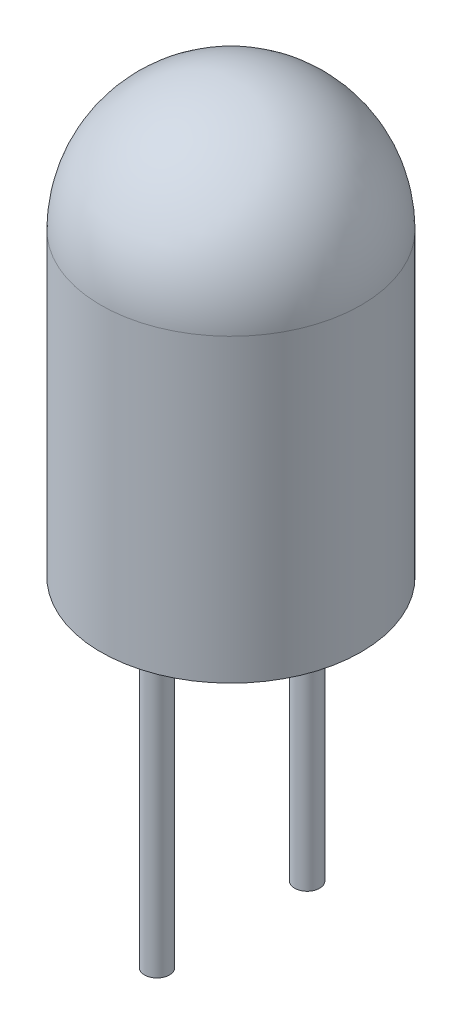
ISO-10303-21;
HEADER;
FILE_DESCRIPTION(('STEP AP214'),'2;1');
FILE_NAME('part.step','',(''),(''),'','','');
FILE_SCHEMA(('AUTOMOTIVE_DESIGN { 1 0 10303 214 1 1 1 1 }'));
ENDSEC;
DATA;
#1=APPLICATION_CONTEXT('core data for automotive mechanical design processes');
#2=APPLICATION_PROTOCOL_DEFINITION('international standard','automotive_design',2000,#1);
#3=PRODUCT_CONTEXT('',#1,'mechanical');
#4=PRODUCT('Part','Part','',(#3));
#5=PRODUCT_RELATED_PRODUCT_CATEGORY('part','',(#4));
#6=PRODUCT_DEFINITION_FORMATION('','',#4);
#7=PRODUCT_DEFINITION_CONTEXT('part definition',#1,'design');
#8=PRODUCT_DEFINITION('design','',#6,#7);
#9=PRODUCT_DEFINITION_SHAPE('','',#8);
#10=(LENGTH_UNIT() NAMED_UNIT(*) SI_UNIT(.MILLI.,.METRE.));
#11=(NAMED_UNIT(*) PLANE_ANGLE_UNIT() SI_UNIT($,.RADIAN.));
#12=(NAMED_UNIT(*) SI_UNIT($,.STERADIAN.) SOLID_ANGLE_UNIT());
#13=UNCERTAINTY_MEASURE_WITH_UNIT(LENGTH_MEASURE(1.E-05),#10,'distance_accuracy_value','');
#14=(GEOMETRIC_REPRESENTATION_CONTEXT(3) GLOBAL_UNCERTAINTY_ASSIGNED_CONTEXT((#13)) GLOBAL_UNIT_ASSIGNED_CONTEXT((#10,
#11,#12)) REPRESENTATION_CONTEXT('',''));
#15=CARTESIAN_POINT('',(0.,0.,0.));
#16=DIRECTION('',(0.,0.,1.));
#17=DIRECTION('',(1.,0.,0.));
#18=AXIS2_PLACEMENT_3D('',#15,#16,#17);
#19=CARTESIAN_POINT('',(-1.11022302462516E-13,-8.59999999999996,0.));
#20=DIRECTION('',(0.,-0.999999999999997,0.));
#21=DIRECTION('',(1.00000000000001,0.,0.));
#22=AXIS2_PLACEMENT_3D('',#19,#20,#21);
#23=PLANE('',#22);
#24=CARTESIAN_POINT('',(0.0221566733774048,-8.59999999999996,1.49983635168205));
#25=DIRECTION('',(0.,-0.999999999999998,0.));
#26=DIRECTION('',(0.,0.,-1.));
#27=AXIS2_PLACEMENT_3D('',#24,#25,#26);
#28=CIRCLE('',#27,0.25);
#29=CARTESIAN_POINT('',(0.022156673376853,-8.59999999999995,1.74983635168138));
#30=VERTEX_POINT('',#29);
#31=EDGE_CURVE('E34',#30,#30,#28,.T.);
#32=ORIENTED_EDGE('',*,*,#31,.F.);
#33=EDGE_LOOP('',(#32));
#34=FACE_BOUND('',#33,.T.);
#35=CARTESIAN_POINT('',(-1.11022302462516E-13,-8.59999999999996,0.));
#36=DIRECTION('',(0.,-0.999999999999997,0.));
#37=DIRECTION('',(1.00000000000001,0.,0.));
#38=AXIS2_PLACEMENT_3D('',#35,#36,#37);
#39=CIRCLE('',#38,2.60000000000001);
#40=CARTESIAN_POINT('',(2.59999999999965,-8.59999999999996,1.83613667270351E-13));
#41=VERTEX_POINT('',#40);
#42=EDGE_CURVE('E10',#41,#41,#39,.T.);
#43=ORIENTED_EDGE('',*,*,#42,.T.);
#44=EDGE_LOOP('',(#43));
#45=FACE_BOUND('',#44,.T.);
#46=CARTESIAN_POINT('',(0.0221566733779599,-8.59999999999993,-1.49983635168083));
#47=DIRECTION('',(0.,-0.999999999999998,0.));
#48=DIRECTION('',(0.,0.,1.));
#49=AXIS2_PLACEMENT_3D('',#46,#47,#48);
#50=CIRCLE('',#49,0.25);
#51=CARTESIAN_POINT('',(0.0221566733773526,-8.59999999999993,-1.24983635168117));
#52=VERTEX_POINT('',#51);
#53=EDGE_CURVE('E42',#52,#52,#50,.T.);
#54=ORIENTED_EDGE('',*,*,#53,.F.);
#55=EDGE_LOOP('',(#54));
#56=FACE_BOUND('',#55,.T.);
#57=ADVANCED_FACE('F20',(#34,#45,#56),#23,.T.);
#58=CARTESIAN_POINT('',(-3.88578058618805E-13,-39.9142857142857,2.22044604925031E-13));
#59=DIRECTION('',(0.,-0.999999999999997,0.));
#60=DIRECTION('',(1.00000000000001,0.,0.));
#61=AXIS2_PLACEMENT_3D('',#58,#59,#60);
#62=CYLINDRICAL_SURFACE('',#61,2.60000000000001);
#63=CARTESIAN_POINT('',(8.32667268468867E-13,-2.59999999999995,7.7715611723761E-13));
#64=DIRECTION('',(0.,-0.999999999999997,0.));
#65=DIRECTION('',(1.00000000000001,0.,0.));
#66=AXIS2_PLACEMENT_3D('',#63,#64,#65);
#67=CIRCLE('',#66,2.60000000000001);
#68=CARTESIAN_POINT('',(2.59999999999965,-2.59999999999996,1.76549046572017E-13));
#69=VERTEX_POINT('',#68);
#70=EDGE_CURVE('E26',#69,#69,#67,.T.);
#71=CARTESIAN_POINT('',(2.59999999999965,-2.59999999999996,1.76549046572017E-13));
#72=CARTESIAN_POINT('',(2.59999999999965,-2.66249999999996,1.76622636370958E-13));
#73=CARTESIAN_POINT('',(2.59999999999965,-2.72499999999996,1.76696226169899E-13));
#74=CARTESIAN_POINT('',(2.59999999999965,-2.84999999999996,1.76843405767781E-13));
#75=CARTESIAN_POINT('',(2.59999999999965,-2.91249999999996,1.76916995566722E-13));
#76=CARTESIAN_POINT('',(2.59999999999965,-3.03749999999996,1.77064175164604E-13));
#77=CARTESIAN_POINT('',(2.59999999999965,-3.09999999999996,1.77137764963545E-13));
#78=CARTESIAN_POINT('',(2.59999999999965,-3.22499999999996,1.77284944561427E-13));
#79=CARTESIAN_POINT('',(2.59999999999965,-3.28749999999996,1.77358534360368E-13));
#80=CARTESIAN_POINT('',(2.59999999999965,-3.41249999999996,1.7750571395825E-13));
#81=CARTESIAN_POINT('',(2.59999999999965,-3.47499999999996,1.77579303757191E-13));
#82=CARTESIAN_POINT('',(2.59999999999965,-3.59999999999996,1.77726483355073E-13));
#83=CARTESIAN_POINT('',(2.59999999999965,-3.66249999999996,1.77800073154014E-13));
#84=CARTESIAN_POINT('',(2.59999999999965,-3.78749999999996,1.77947252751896E-13));
#85=CARTESIAN_POINT('',(2.59999999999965,-3.84999999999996,1.78020842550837E-13));
#86=CARTESIAN_POINT('',(2.59999999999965,-3.97499999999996,1.78168022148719E-13));
#87=CARTESIAN_POINT('',(2.59999999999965,-4.03749999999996,1.7824161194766E-13));
#88=CARTESIAN_POINT('',(2.59999999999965,-4.16249999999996,1.78388791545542E-13));
#89=CARTESIAN_POINT('',(2.59999999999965,-4.22499999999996,1.78462381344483E-13));
#90=CARTESIAN_POINT('',(2.59999999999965,-4.34999999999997,1.78609560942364E-13));
#91=CARTESIAN_POINT('',(2.59999999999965,-4.41249999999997,1.78683150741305E-13));
#92=CARTESIAN_POINT('',(2.59999999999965,-4.53749999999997,1.78830330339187E-13));
#93=CARTESIAN_POINT('',(2.59999999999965,-4.59999999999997,1.78903920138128E-13));
#94=CARTESIAN_POINT('',(2.59999999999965,-4.72499999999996,1.7905109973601E-13));
#95=CARTESIAN_POINT('',(2.59999999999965,-4.78749999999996,1.79124689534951E-13));
#96=CARTESIAN_POINT('',(2.59999999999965,-4.91249999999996,1.79271869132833E-13));
#97=CARTESIAN_POINT('',(2.59999999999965,-4.97499999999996,1.79345458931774E-13));
#98=CARTESIAN_POINT('',(2.59999999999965,-5.09999999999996,1.79492638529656E-13));
#99=CARTESIAN_POINT('',(2.59999999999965,-5.16249999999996,1.79566228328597E-13));
#100=CARTESIAN_POINT('',(2.59999999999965,-5.28749999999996,1.79713407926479E-13));
#101=CARTESIAN_POINT('',(2.59999999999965,-5.34999999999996,1.7978699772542E-13));
#102=CARTESIAN_POINT('',(2.59999999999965,-5.47499999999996,1.79934177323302E-13));
#103=CARTESIAN_POINT('',(2.59999999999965,-5.53749999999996,1.80007767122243E-13));
#104=CARTESIAN_POINT('',(2.59999999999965,-5.66249999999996,1.80154946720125E-13));
#105=CARTESIAN_POINT('',(2.59999999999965,-5.72499999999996,1.80228536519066E-13));
#106=CARTESIAN_POINT('',(2.59999999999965,-5.84999999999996,1.80375716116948E-13));
#107=CARTESIAN_POINT('',(2.59999999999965,-5.91249999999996,1.80449305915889E-13));
#108=CARTESIAN_POINT('',(2.59999999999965,-6.03749999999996,1.80596485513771E-13));
#109=CARTESIAN_POINT('',(2.59999999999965,-6.09999999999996,1.80670075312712E-13));
#110=CARTESIAN_POINT('',(2.59999999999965,-6.22499999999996,1.80817254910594E-13));
#111=CARTESIAN_POINT('',(2.59999999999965,-6.28749999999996,1.80890844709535E-13));
#112=CARTESIAN_POINT('',(2.59999999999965,-6.41249999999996,1.81038024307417E-13));
#113=CARTESIAN_POINT('',(2.59999999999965,-6.47499999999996,1.81111614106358E-13));
#114=CARTESIAN_POINT('',(2.59999999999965,-6.59999999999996,1.8125879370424E-13));
#115=CARTESIAN_POINT('',(2.59999999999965,-6.66249999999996,1.81332383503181E-13));
#116=CARTESIAN_POINT('',(2.59999999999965,-6.78749999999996,1.81479563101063E-13));
#117=CARTESIAN_POINT('',(2.59999999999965,-6.84999999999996,1.81553152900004E-13));
#118=CARTESIAN_POINT('',(2.59999999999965,-6.97499999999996,1.81700332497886E-13));
#119=CARTESIAN_POINT('',(2.59999999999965,-7.03749999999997,1.81773922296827E-13));
#120=CARTESIAN_POINT('',(2.59999999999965,-7.16249999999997,1.81921101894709E-13));
#121=CARTESIAN_POINT('',(2.59999999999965,-7.22499999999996,1.8199469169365E-13));
#122=CARTESIAN_POINT('',(2.59999999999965,-7.34999999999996,1.82141871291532E-13));
#123=CARTESIAN_POINT('',(2.59999999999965,-7.41249999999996,1.82215461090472E-13));
#124=CARTESIAN_POINT('',(2.59999999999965,-7.53749999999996,1.82362640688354E-13));
#125=CARTESIAN_POINT('',(2.59999999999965,-7.59999999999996,1.82436230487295E-13));
#126=CARTESIAN_POINT('',(2.59999999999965,-7.72499999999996,1.82583410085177E-13));
#127=CARTESIAN_POINT('',(2.59999999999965,-7.78749999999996,1.82656999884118E-13));
#128=CARTESIAN_POINT('',(2.59999999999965,-7.91249999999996,1.82804179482E-13));
#129=CARTESIAN_POINT('',(2.59999999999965,-7.97499999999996,1.82877769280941E-13));
#130=CARTESIAN_POINT('',(2.59999999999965,-8.09999999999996,1.83024948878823E-13));
#131=CARTESIAN_POINT('',(2.59999999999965,-8.16249999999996,1.83098538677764E-13));
#132=CARTESIAN_POINT('',(2.59999999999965,-8.28749999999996,1.83245718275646E-13));
#133=CARTESIAN_POINT('',(2.59999999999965,-8.34999999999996,1.83319308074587E-13));
#134=CARTESIAN_POINT('',(2.59999999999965,-8.47499999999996,1.83466487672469E-13));
#135=CARTESIAN_POINT('',(2.59999999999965,-8.53749999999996,1.8354007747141E-13));
#136=CARTESIAN_POINT('',(2.59999999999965,-8.59999999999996,1.83613667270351E-13));
#137=B_SPLINE_CURVE_WITH_KNOTS('',3,(#71,#72,#73,#74,#75,#76,#77,#78,#79,#80,#81,#82,#83,#84,
#85,#86,#87,#88,#89,#90,#91,#92,#93,#94,#95,#96,#97,#98,#99,#100,#101,#102,#103,#104,#105,#106,
#107,#108,#109,#110,#111,#112,#113,#114,#115,#116,#117,#118,#119,#120,#121,#122,#123,#124,#125,
#126,#127,#128,#129,#130,#131,#132,#133,#134,#135,#136),.UNSPECIFIED.,.F.,.F.,(4,2,2,2,2,2,2,2,
2,2,2,2,2,2,2,2,2,2,2,2,2,2,2,2,2,2,2,2,2,2,2,2,4),(0.,0.1875,0.375,0.5625,0.750000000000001,
0.937500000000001,1.125,1.3125,1.5,1.68750000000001,1.87500000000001,2.06250000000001,2.25,
2.4375,2.625,2.8125,3.,3.1875,3.375,3.5625,3.75,3.9375,4.125,4.3125,4.50000000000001,4.6875,
4.875,5.0625,5.25,5.4375,5.62500000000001,5.81250000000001,6.00000000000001),.UNSPECIFIED.);
#138=EDGE_CURVE('BSEAM49',#69,#41,#137,.T.);
#139=ORIENTED_EDGE('',*,*,#70,.T.);
#140=ORIENTED_EDGE('',*,*,#42,.F.);
#141=ORIENTED_EDGE('',*,*,#138,.T.);
#142=ORIENTED_EDGE('',*,*,#138,.F.);
#143=EDGE_LOOP('',(#139,#141,#140,#142));
#144=FACE_BOUND('',#143,.T.);
#145=ADVANCED_FACE('F49',(#144),#62,.T.);
#146=CARTESIAN_POINT('',(8.32667268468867E-13,-2.59999999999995,7.7715611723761E-13));
#147=DIRECTION('',(0.,-0.999999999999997,0.));
#148=DIRECTION('',(1.00000000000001,0.,0.));
#149=AXIS2_PLACEMENT_3D('',#146,#147,#148);
#150=SPHERICAL_SURFACE('',#149,2.6);
#151=ORIENTED_EDGE('',*,*,#70,.F.);
#152=EDGE_LOOP('',(#151));
#153=FACE_BOUND('',#152,.T.);
#154=ADVANCED_FACE('F56',(#153),#150,.T.);
#155=CARTESIAN_POINT('',(0.0221566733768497,-14.6,1.49983635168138));
#156=DIRECTION('',(0.,0.999999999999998,0.));
#157=DIRECTION('',(0.,0.,1.));
#158=AXIS2_PLACEMENT_3D('',#155,#156,#157);
#159=CYLINDRICAL_SURFACE('',#158,0.25);
#160=CARTESIAN_POINT('',(0.0221566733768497,-14.6,1.49983635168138));
#161=DIRECTION('',(0.,-0.999999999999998,0.));
#162=DIRECTION('',(0.,0.,-1.));
#163=AXIS2_PLACEMENT_3D('',#160,#161,#162);
#164=CIRCLE('',#163,0.25);
#165=CARTESIAN_POINT('',(0.0221566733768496,-14.6,1.74983635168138));
#166=VERTEX_POINT('',#165);
#167=EDGE_CURVE('E30',#166,#166,#164,.T.);
#168=CARTESIAN_POINT('',(0.0221566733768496,-14.6,1.74983635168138));
#169=CARTESIAN_POINT('',(0.0221566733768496,-14.5375,1.74983635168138));
#170=CARTESIAN_POINT('',(0.0221566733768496,-14.475,1.74983635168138));
#171=CARTESIAN_POINT('',(0.0221566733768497,-14.35,1.74983635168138));
#172=CARTESIAN_POINT('',(0.0221566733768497,-14.2875,1.74983635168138));
#173=CARTESIAN_POINT('',(0.0221566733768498,-14.1625,1.74983635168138));
#174=CARTESIAN_POINT('',(0.0221566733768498,-14.1,1.74983635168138));
#175=CARTESIAN_POINT('',(0.0221566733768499,-13.975,1.74983635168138));
#176=CARTESIAN_POINT('',(0.02215667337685,-13.9125,1.74983635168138));
#177=CARTESIAN_POINT('',(0.02215667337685,-13.7875,1.74983635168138));
#178=CARTESIAN_POINT('',(0.0221566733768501,-13.725,1.74983635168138));
#179=CARTESIAN_POINT('',(0.0221566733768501,-13.6,1.74983635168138));
#180=CARTESIAN_POINT('',(0.0221566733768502,-13.5375,1.74983635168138));
#181=CARTESIAN_POINT('',(0.0221566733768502,-13.4125,1.74983635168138));
#182=CARTESIAN_POINT('',(0.0221566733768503,-13.35,1.74983635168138));
#183=CARTESIAN_POINT('',(0.0221566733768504,-13.225,1.74983635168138));
#184=CARTESIAN_POINT('',(0.0221566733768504,-13.1625,1.74983635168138));
#185=CARTESIAN_POINT('',(0.0221566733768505,-13.0375,1.74983635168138));
#186=CARTESIAN_POINT('',(0.0221566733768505,-12.975,1.74983635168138));
#187=CARTESIAN_POINT('',(0.0221566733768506,-12.85,1.74983635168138));
#188=CARTESIAN_POINT('',(0.0221566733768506,-12.7875,1.74983635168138));
#189=CARTESIAN_POINT('',(0.0221566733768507,-12.6625,1.74983635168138));
#190=CARTESIAN_POINT('',(0.0221566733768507,-12.6,1.74983635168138));
#191=CARTESIAN_POINT('',(0.0221566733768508,-12.475,1.74983635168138));
#192=CARTESIAN_POINT('',(0.0221566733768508,-12.4125,1.74983635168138));
#193=CARTESIAN_POINT('',(0.0221566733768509,-12.2875,1.74983635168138));
#194=CARTESIAN_POINT('',(0.0221566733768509,-12.225,1.74983635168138));
#195=CARTESIAN_POINT('',(0.022156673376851,-12.1,1.74983635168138));
#196=CARTESIAN_POINT('',(0.022156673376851,-12.0375,1.74983635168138));
#197=CARTESIAN_POINT('',(0.0221566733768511,-11.9125,1.74983635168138));
#198=CARTESIAN_POINT('',(0.0221566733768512,-11.85,1.74983635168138));
#199=CARTESIAN_POINT('',(0.0221566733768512,-11.725,1.74983635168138));
#200=CARTESIAN_POINT('',(0.0221566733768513,-11.6625,1.74983635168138));
#201=CARTESIAN_POINT('',(0.0221566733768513,-11.5375,1.74983635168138));
#202=CARTESIAN_POINT('',(0.0221566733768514,-11.475,1.74983635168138));
#203=CARTESIAN_POINT('',(0.0221566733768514,-11.35,1.74983635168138));
#204=CARTESIAN_POINT('',(0.0221566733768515,-11.2875,1.74983635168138));
#205=CARTESIAN_POINT('',(0.0221566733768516,-11.1625,1.74983635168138));
#206=CARTESIAN_POINT('',(0.0221566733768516,-11.1,1.74983635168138));
#207=CARTESIAN_POINT('',(0.0221566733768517,-10.975,1.74983635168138));
#208=CARTESIAN_POINT('',(0.0221566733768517,-10.9125,1.74983635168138));
#209=CARTESIAN_POINT('',(0.0221566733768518,-10.7875,1.74983635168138));
#210=CARTESIAN_POINT('',(0.0221566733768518,-10.725,1.74983635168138));
#211=CARTESIAN_POINT('',(0.0221566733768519,-10.6,1.74983635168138));
#212=CARTESIAN_POINT('',(0.0221566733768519,-10.5375,1.74983635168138));
#213=CARTESIAN_POINT('',(0.022156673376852,-10.4125,1.74983635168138));
#214=CARTESIAN_POINT('',(0.022156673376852,-10.35,1.74983635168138));
#215=CARTESIAN_POINT('',(0.0221566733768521,-10.225,1.74983635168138));
#216=CARTESIAN_POINT('',(0.0221566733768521,-10.1625,1.74983635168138));
#217=CARTESIAN_POINT('',(0.0221566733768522,-10.0375,1.74983635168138));
#218=CARTESIAN_POINT('',(0.0221566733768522,-9.97499999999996,1.74983635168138));
#219=CARTESIAN_POINT('',(0.0221566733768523,-9.84999999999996,1.74983635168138));
#220=CARTESIAN_POINT('',(0.0221566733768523,-9.78749999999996,1.74983635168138));
#221=CARTESIAN_POINT('',(0.0221566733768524,-9.66249999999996,1.74983635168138));
#222=CARTESIAN_POINT('',(0.0221566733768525,-9.59999999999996,1.74983635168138));
#223=CARTESIAN_POINT('',(0.0221566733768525,-9.47499999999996,1.74983635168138));
#224=CARTESIAN_POINT('',(0.0221566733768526,-9.41249999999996,1.74983635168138));
#225=CARTESIAN_POINT('',(0.0221566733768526,-9.28749999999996,1.74983635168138));
#226=CARTESIAN_POINT('',(0.0221566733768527,-9.22499999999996,1.74983635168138));
#227=CARTESIAN_POINT('',(0.0221566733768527,-9.09999999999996,1.74983635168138));
#228=CARTESIAN_POINT('',(0.0221566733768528,-9.03749999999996,1.74983635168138));
#229=CARTESIAN_POINT('',(0.0221566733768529,-8.91249999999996,1.74983635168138));
#230=CARTESIAN_POINT('',(0.0221566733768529,-8.84999999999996,1.74983635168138));
#231=CARTESIAN_POINT('',(0.022156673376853,-8.72499999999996,1.74983635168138));
#232=CARTESIAN_POINT('',(0.022156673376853,-8.66249999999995,1.74983635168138));
#233=CARTESIAN_POINT('',(0.022156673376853,-8.59999999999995,1.74983635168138));
#234=B_SPLINE_CURVE_WITH_KNOTS('',3,(#168,#169,#170,#171,#172,#173,#174,#175,#176,#177,#178,
#179,#180,#181,#182,#183,#184,#185,#186,#187,#188,#189,#190,#191,#192,#193,#194,#195,#196,#197,
#198,#199,#200,#201,#202,#203,#204,#205,#206,#207,#208,#209,#210,#211,#212,#213,#214,#215,#216,
#217,#218,#219,#220,#221,#222,#223,#224,#225,#226,#227,#228,#229,#230,#231,#232,#233),
.UNSPECIFIED.,.F.,.F.,(4,2,2,2,2,2,2,2,2,2,2,2,2,2,2,2,2,2,2,2,2,2,2,2,2,2,2,2,2,2,2,2,4),(0.,
0.1875,0.375000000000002,0.562500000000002,0.750000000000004,0.937500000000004,1.12500000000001,
1.31250000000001,1.50000000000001,1.68750000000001,1.87500000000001,2.06250000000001,
2.25000000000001,2.43750000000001,2.62500000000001,2.81250000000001,3.00000000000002,
3.18750000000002,3.37500000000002,3.56250000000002,3.75000000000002,3.93750000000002,
4.12500000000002,4.31250000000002,4.50000000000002,4.68750000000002,4.87500000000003,
5.06250000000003,5.25000000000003,5.43750000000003,5.62500000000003,5.81250000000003,
6.00000000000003),.UNSPECIFIED.);
#235=EDGE_CURVE('BSEAM59',#166,#30,#234,.T.);
#236=ORIENTED_EDGE('',*,*,#167,.F.);
#237=ORIENTED_EDGE('',*,*,#31,.T.);
#238=ORIENTED_EDGE('',*,*,#235,.T.);
#239=ORIENTED_EDGE('',*,*,#235,.F.);
#240=EDGE_LOOP('',(#236,#238,#237,#239));
#241=FACE_BOUND('',#240,.T.);
#242=ADVANCED_FACE('F59',(#241),#159,.T.);
#243=CARTESIAN_POINT('',(0.0221566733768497,-14.6,1.49983635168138));
#244=DIRECTION('',(0.,-0.999999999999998,0.));
#245=DIRECTION('',(0.,0.,-1.));
#246=AXIS2_PLACEMENT_3D('',#243,#244,#245);
#247=PLANE('',#246);
#248=ORIENTED_EDGE('',*,*,#167,.T.);
#249=EDGE_LOOP('',(#248));
#250=FACE_BOUND('',#249,.T.);
#251=ADVANCED_FACE('F60',(#250),#247,.T.);
#252=CARTESIAN_POINT('',(0.0221566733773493,-14.5999999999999,-1.49983635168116));
#253=DIRECTION('',(0.,0.999999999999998,0.));
#254=DIRECTION('',(0.,0.,1.));
#255=AXIS2_PLACEMENT_3D('',#252,#253,#254);
#256=CYLINDRICAL_SURFACE('',#255,0.25);
#257=CARTESIAN_POINT('',(0.0221566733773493,-14.5999999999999,-1.49983635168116));
#258=DIRECTION('',(0.,-0.999999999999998,0.));
#259=DIRECTION('',(0.,0.,1.));
#260=AXIS2_PLACEMENT_3D('',#257,#258,#259);
#261=CIRCLE('',#260,0.25);
#262=CARTESIAN_POINT('',(0.0221566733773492,-14.5999999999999,-1.24983635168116));
#263=VERTEX_POINT('',#262);
#264=EDGE_CURVE('E39',#263,#263,#261,.T.);
#265=CARTESIAN_POINT('',(0.0221566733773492,-14.5999999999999,-1.24983635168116));
#266=CARTESIAN_POINT('',(0.0221566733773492,-14.5374999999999,-1.24983635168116));
#267=CARTESIAN_POINT('',(0.0221566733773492,-14.4749999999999,-1.24983635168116));
#268=CARTESIAN_POINT('',(0.0221566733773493,-14.3499999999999,-1.24983635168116));
#269=CARTESIAN_POINT('',(0.0221566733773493,-14.2874999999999,-1.24983635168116));
#270=CARTESIAN_POINT('',(0.0221566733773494,-14.1624999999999,-1.24983635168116));
#271=CARTESIAN_POINT('',(0.0221566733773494,-14.0999999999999,-1.24983635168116));
#272=CARTESIAN_POINT('',(0.0221566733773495,-13.9749999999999,-1.24983635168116));
#273=CARTESIAN_POINT('',(0.0221566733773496,-13.9124999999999,-1.24983635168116));
#274=CARTESIAN_POINT('',(0.0221566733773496,-13.7874999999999,-1.24983635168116));
#275=CARTESIAN_POINT('',(0.0221566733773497,-13.7249999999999,-1.24983635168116));
#276=CARTESIAN_POINT('',(0.0221566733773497,-13.5999999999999,-1.24983635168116));
#277=CARTESIAN_POINT('',(0.0221566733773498,-13.5374999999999,-1.24983635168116));
#278=CARTESIAN_POINT('',(0.0221566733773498,-13.4124999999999,-1.24983635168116));
#279=CARTESIAN_POINT('',(0.0221566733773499,-13.3499999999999,-1.24983635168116));
#280=CARTESIAN_POINT('',(0.02215667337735,-13.2249999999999,-1.24983635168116));
#281=CARTESIAN_POINT('',(0.02215667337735,-13.1624999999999,-1.24983635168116));
#282=CARTESIAN_POINT('',(0.0221566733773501,-13.0374999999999,-1.24983635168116));
#283=CARTESIAN_POINT('',(0.0221566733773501,-12.9749999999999,-1.24983635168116));
#284=CARTESIAN_POINT('',(0.0221566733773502,-12.8499999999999,-1.24983635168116));
#285=CARTESIAN_POINT('',(0.0221566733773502,-12.7874999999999,-1.24983635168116));
#286=CARTESIAN_POINT('',(0.0221566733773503,-12.6624999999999,-1.24983635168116));
#287=CARTESIAN_POINT('',(0.0221566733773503,-12.5999999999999,-1.24983635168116));
#288=CARTESIAN_POINT('',(0.0221566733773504,-12.4749999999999,-1.24983635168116));
#289=CARTESIAN_POINT('',(0.0221566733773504,-12.4124999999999,-1.24983635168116));
#290=CARTESIAN_POINT('',(0.0221566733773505,-12.2874999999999,-1.24983635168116));
#291=CARTESIAN_POINT('',(0.0221566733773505,-12.2249999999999,-1.24983635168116));
#292=CARTESIAN_POINT('',(0.0221566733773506,-12.0999999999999,-1.24983635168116));
#293=CARTESIAN_POINT('',(0.0221566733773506,-12.0374999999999,-1.24983635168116));
#294=CARTESIAN_POINT('',(0.0221566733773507,-11.9124999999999,-1.24983635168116));
#295=CARTESIAN_POINT('',(0.0221566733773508,-11.8499999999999,-1.24983635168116));
#296=CARTESIAN_POINT('',(0.0221566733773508,-11.7249999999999,-1.24983635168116));
#297=CARTESIAN_POINT('',(0.0221566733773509,-11.6624999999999,-1.24983635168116));
#298=CARTESIAN_POINT('',(0.0221566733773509,-11.5374999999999,-1.24983635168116));
#299=CARTESIAN_POINT('',(0.022156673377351,-11.4749999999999,-1.24983635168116));
#300=CARTESIAN_POINT('',(0.022156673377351,-11.3499999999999,-1.24983635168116));
#301=CARTESIAN_POINT('',(0.0221566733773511,-11.2874999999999,-1.24983635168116));
#302=CARTESIAN_POINT('',(0.0221566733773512,-11.1624999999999,-1.24983635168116));
#303=CARTESIAN_POINT('',(0.0221566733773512,-11.0999999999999,-1.24983635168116));
#304=CARTESIAN_POINT('',(0.0221566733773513,-10.9749999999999,-1.24983635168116));
#305=CARTESIAN_POINT('',(0.0221566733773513,-10.9124999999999,-1.24983635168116));
#306=CARTESIAN_POINT('',(0.0221566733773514,-10.7874999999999,-1.24983635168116));
#307=CARTESIAN_POINT('',(0.0221566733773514,-10.7249999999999,-1.24983635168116));
#308=CARTESIAN_POINT('',(0.0221566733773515,-10.5999999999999,-1.24983635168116));
#309=CARTESIAN_POINT('',(0.0221566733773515,-10.5374999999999,-1.24983635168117));
#310=CARTESIAN_POINT('',(0.0221566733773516,-10.4124999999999,-1.24983635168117));
#311=CARTESIAN_POINT('',(0.0221566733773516,-10.3499999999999,-1.24983635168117));
#312=CARTESIAN_POINT('',(0.0221566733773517,-10.2249999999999,-1.24983635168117));
#313=CARTESIAN_POINT('',(0.0221566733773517,-10.1624999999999,-1.24983635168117));
#314=CARTESIAN_POINT('',(0.0221566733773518,-10.0374999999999,-1.24983635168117));
#315=CARTESIAN_POINT('',(0.0221566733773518,-9.97499999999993,-1.24983635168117));
#316=CARTESIAN_POINT('',(0.0221566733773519,-9.84999999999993,-1.24983635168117));
#317=CARTESIAN_POINT('',(0.0221566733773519,-9.78749999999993,-1.24983635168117));
#318=CARTESIAN_POINT('',(0.022156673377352,-9.66249999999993,-1.24983635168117));
#319=CARTESIAN_POINT('',(0.0221566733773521,-9.59999999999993,-1.24983635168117));
#320=CARTESIAN_POINT('',(0.0221566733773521,-9.47499999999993,-1.24983635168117));
#321=CARTESIAN_POINT('',(0.0221566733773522,-9.41249999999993,-1.24983635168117));
#322=CARTESIAN_POINT('',(0.0221566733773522,-9.28749999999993,-1.24983635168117));
#323=CARTESIAN_POINT('',(0.0221566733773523,-9.22499999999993,-1.24983635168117));
#324=CARTESIAN_POINT('',(0.0221566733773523,-9.09999999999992,-1.24983635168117));
#325=CARTESIAN_POINT('',(0.0221566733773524,-9.03749999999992,-1.24983635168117));
#326=CARTESIAN_POINT('',(0.0221566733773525,-8.91249999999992,-1.24983635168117));
#327=CARTESIAN_POINT('',(0.0221566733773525,-8.84999999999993,-1.24983635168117));
#328=CARTESIAN_POINT('',(0.0221566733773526,-8.72499999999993,-1.24983635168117));
#329=CARTESIAN_POINT('',(0.0221566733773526,-8.66249999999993,-1.24983635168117));
#330=CARTESIAN_POINT('',(0.0221566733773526,-8.59999999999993,-1.24983635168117));
#331=B_SPLINE_CURVE_WITH_KNOTS('',3,(#265,#266,#267,#268,#269,#270,#271,#272,#273,#274,#275,
#276,#277,#278,#279,#280,#281,#282,#283,#284,#285,#286,#287,#288,#289,#290,#291,#292,#293,#294,
#295,#296,#297,#298,#299,#300,#301,#302,#303,#304,#305,#306,#307,#308,#309,#310,#311,#312,#313,
#314,#315,#316,#317,#318,#319,#320,#321,#322,#323,#324,#325,#326,#327,#328,#329,#330),
.UNSPECIFIED.,.F.,.F.,(4,2,2,2,2,2,2,2,2,2,2,2,2,2,2,2,2,2,2,2,2,2,2,2,2,2,2,2,2,2,2,2,4),(0.,
0.1875,0.375,0.5625,0.750000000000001,0.937499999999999,1.125,1.3125,1.5,1.6875,1.875,2.0625,
2.25,2.4375,2.625,2.8125,3.,3.1875,3.375,3.5625,3.75,3.9375,4.125,4.3125,4.5,4.68749999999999,
4.87499999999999,5.06249999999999,5.24999999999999,5.43749999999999,5.62499999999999,
5.81249999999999,5.99999999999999),.UNSPECIFIED.);
#332=EDGE_CURVE('BSEAM46',#263,#52,#331,.T.);
#333=ORIENTED_EDGE('',*,*,#264,.F.);
#334=ORIENTED_EDGE('',*,*,#53,.T.);
#335=ORIENTED_EDGE('',*,*,#332,.T.);
#336=ORIENTED_EDGE('',*,*,#332,.F.);
#337=EDGE_LOOP('',(#333,#335,#334,#336));
#338=FACE_BOUND('',#337,.T.);
#339=ADVANCED_FACE('F46',(#338),#256,.T.);
#340=CARTESIAN_POINT('',(0.0221566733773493,-14.5999999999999,-1.49983635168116));
#341=DIRECTION('',(0.,0.999999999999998,0.));
#342=DIRECTION('',(0.,0.,1.));
#343=AXIS2_PLACEMENT_3D('',#340,#341,#342);
#344=PLANE('',#343);
#345=ORIENTED_EDGE('',*,*,#264,.T.);
#346=EDGE_LOOP('',(#345));
#347=FACE_BOUND('',#346,.T.);
#348=ADVANCED_FACE('F74',(#347),#344,.F.);
#349=CLOSED_SHELL('',(#57,#145,#154,#242,#251,#339,#348));
#350=MANIFOLD_SOLID_BREP('B2',#349);
#351=ADVANCED_BREP_SHAPE_REPRESENTATION('',(#18,#350),#14);
#352=SHAPE_DEFINITION_REPRESENTATION(#9,#351);
ENDSEC;
END-ISO-10303-21;
